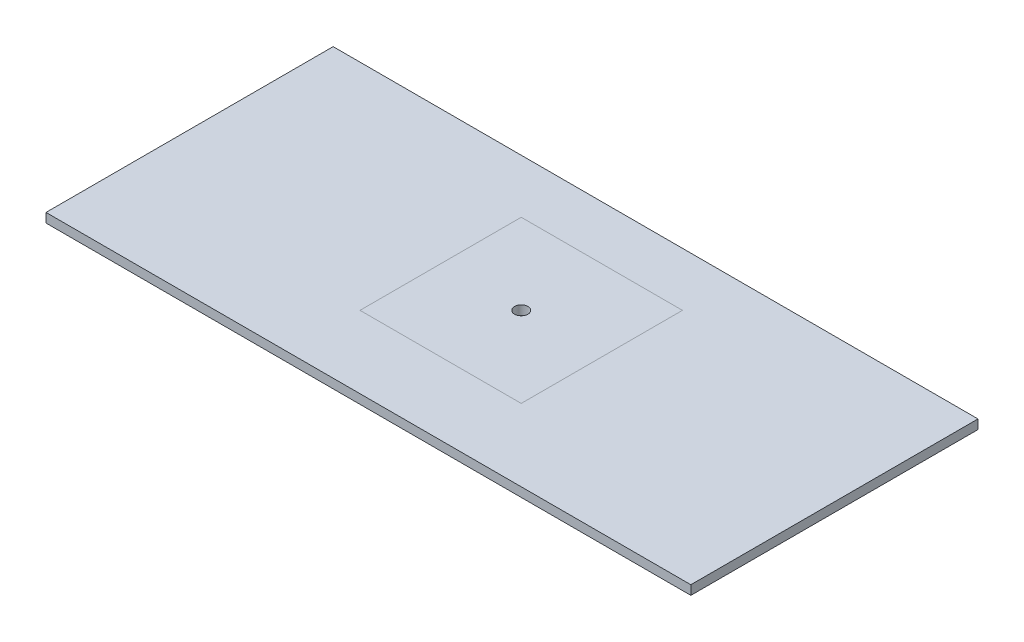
from build123d import *

# Parameters (mm, degrees)
SKETCH1_W           = 1219.2
SKETCH1_H           = 17.4625
BOSS_EXTRUDE1_DEPTH = 542.925
SKETCH2_R           = 12.7
CUT_EXTRUDE1_DEPTH  = 817.507596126
SKETCH3_W           = 304.8
SKETCH3_H           = 304.8
SKETCH3_R           = 12.7
CUT_EXTRUDE2_DEPTH  = 0.000254


with BuildPart() as part:
    # Sketch1 → Boss-Extrude1 (new body)
    with BuildSketch(Plane.XY):
        Rectangle(SKETCH1_W, SKETCH1_H)
    extrude(amount=BOSS_EXTRUDE1_DEPTH)

    # Sketch2 → Cut-Extrude1 (cut, through all)
    with BuildSketch(Plane(origin=(0, 8.73125, 0), x_dir=(1, 0, 0), z_dir=(0, 1, 0))):
        with Locations(Location((0, -254, 0), (0, 0, 270))):
            Circle(SKETCH2_R)
    extrude(amount=-CUT_EXTRUDE1_DEPTH, mode=Mode.SUBTRACT)

    # Sketch3 → Cut-Extrude2 (cut)
    with BuildSketch(Plane(origin=(0, 8.73125, 0), x_dir=(1, 0, 0), z_dir=(0, 1, 0))):
        with Locations((0, -254)):
            Rectangle(SKETCH3_W, SKETCH3_H)
        with Locations(Location((0, -254, 0), (0, 0, 270))):
            Circle(SKETCH3_R, mode=Mode.SUBTRACT)
    extrude(amount=-CUT_EXTRUDE2_DEPTH, mode=Mode.SUBTRACT)


solid = part.part
